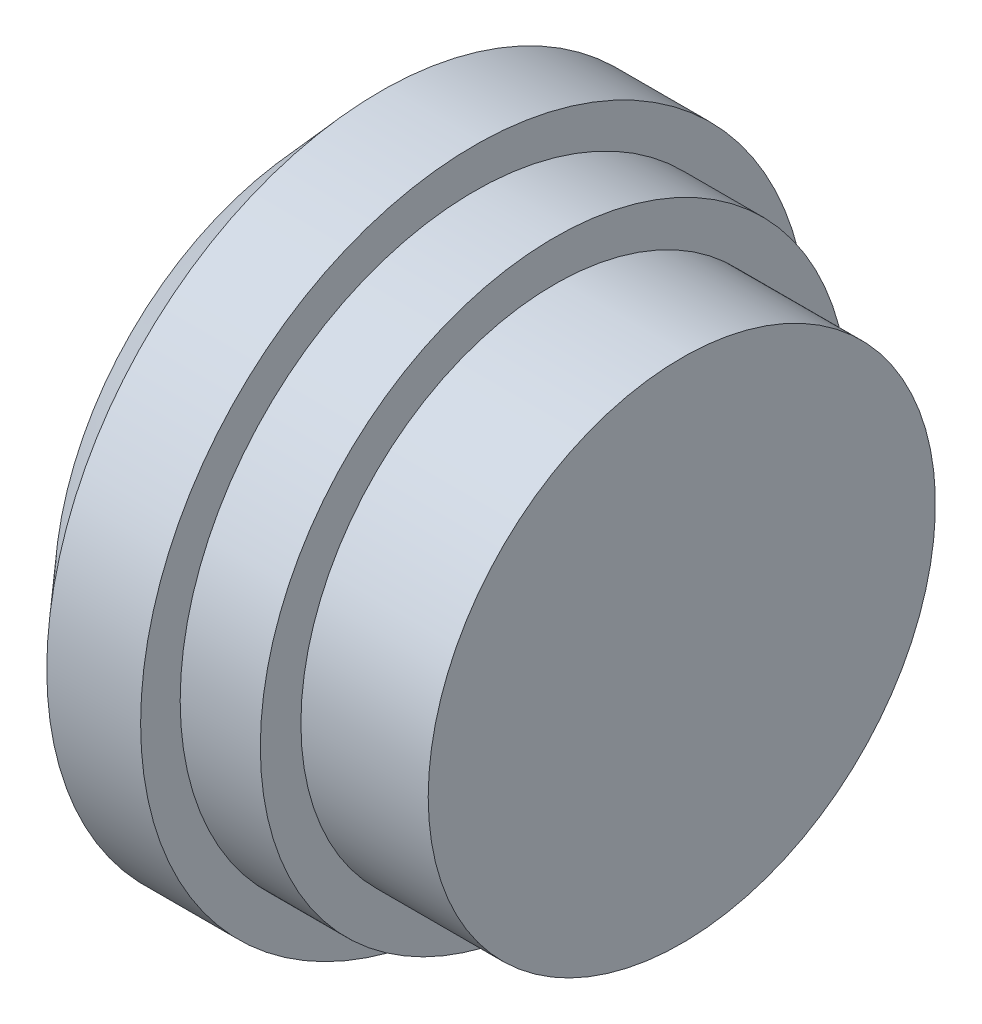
from build123d import *

# Parameters (mm, degrees)
SKETCH4_R          = 11.049
CUT_EXTRUDE1_DEPTH = 17.4625


with BuildPart() as part:
    # Sketch1 → Revolve1 (revolve)
    with BuildSketch(Plane.XY, mode=Mode.PRIVATE) as revolve1_sk:
        Polygon((0, 0), (-6.3754, 0), (-6.3754, -2.032), (-10.3886, -2.032), (-10.3886, -4.0132), (-15.0876, -4.0132), (-18.288, -0.4318), (-18.288, 12.7), (0, 12.7), align=None)
    revolve(revolve1_sk.sketch.rotate(Axis((-18.288, 12.7, 0), (1, 0, 0)), 270), axis=Axis((-18.288, 12.7, 0), (1, 0, 0)))

    # Sketch4 → Cut-Extrude1 (cut)
    with BuildSketch(Plane.ZY.offset(18.288)):
        with Locations((0, 12.7)):
            Circle(SKETCH4_R)
    extrude(amount=-CUT_EXTRUDE1_DEPTH, mode=Mode.SUBTRACT)


solid = part.part
